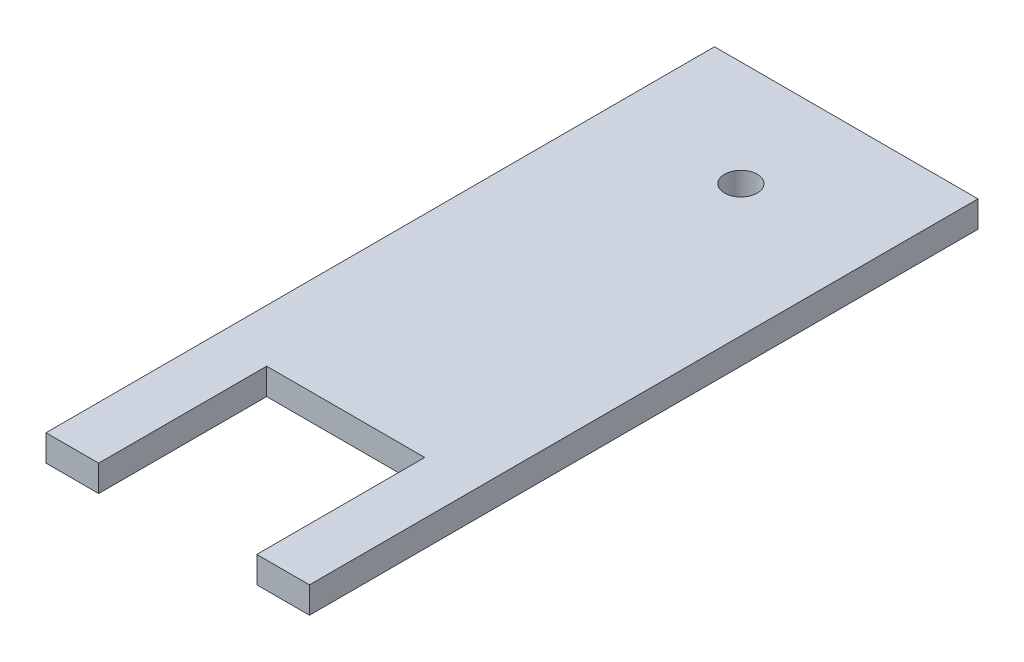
ISO-10303-21;
HEADER;
FILE_DESCRIPTION(('STEP AP214'),'2;1');
FILE_NAME('part.step','',(''),(''),'','','');
FILE_SCHEMA(('AUTOMOTIVE_DESIGN { 1 0 10303 214 1 1 1 1 }'));
ENDSEC;
DATA;
#1=APPLICATION_CONTEXT('core data for automotive mechanical design processes');
#2=APPLICATION_PROTOCOL_DEFINITION('international standard','automotive_design',2000,#1);
#3=PRODUCT_CONTEXT('',#1,'mechanical');
#4=PRODUCT('Part','Part','',(#3));
#5=PRODUCT_RELATED_PRODUCT_CATEGORY('part','',(#4));
#6=PRODUCT_DEFINITION_FORMATION('','',#4);
#7=PRODUCT_DEFINITION_CONTEXT('part definition',#1,'design');
#8=PRODUCT_DEFINITION('design','',#6,#7);
#9=PRODUCT_DEFINITION_SHAPE('','',#8);
#10=(LENGTH_UNIT() NAMED_UNIT(*) SI_UNIT(.MILLI.,.METRE.));
#11=(NAMED_UNIT(*) PLANE_ANGLE_UNIT() SI_UNIT($,.RADIAN.));
#12=(NAMED_UNIT(*) SI_UNIT($,.STERADIAN.) SOLID_ANGLE_UNIT());
#13=UNCERTAINTY_MEASURE_WITH_UNIT(LENGTH_MEASURE(1.E-05),#10,'distance_accuracy_value','');
#14=(GEOMETRIC_REPRESENTATION_CONTEXT(3) GLOBAL_UNCERTAINTY_ASSIGNED_CONTEXT((#13)) GLOBAL_UNIT_ASSIGNED_CONTEXT((#10,
#11,#12)) REPRESENTATION_CONTEXT('',''));
#15=CARTESIAN_POINT('',(0.,0.,0.));
#16=DIRECTION('',(0.,0.,1.));
#17=DIRECTION('',(1.,0.,0.));
#18=AXIS2_PLACEMENT_3D('',#15,#16,#17);
#19=CARTESIAN_POINT('',(0.,12.7,-241.3));
#20=DIRECTION('',(0.,0.,-1.));
#21=DIRECTION('',(-1.,0.,0.));
#22=AXIS2_PLACEMENT_3D('',#19,#20,#21);
#23=PLANE('',#22);
#24=DIRECTION('',(1.,0.,0.));
#25=VECTOR('',#24,1.);
#26=CARTESIAN_POINT('',(0.,0.,-241.3));
#27=LINE('',#26,#25);
#28=CARTESIAN_POINT('',(0.,0.,-241.3));
#29=VERTEX_POINT('',#28);
#30=CARTESIAN_POINT('',(127.,0.,-241.3));
#31=VERTEX_POINT('',#30);
#32=EDGE_CURVE('E132',#29,#31,#27,.T.);
#33=ORIENTED_EDGE('',*,*,#32,.F.);
#34=DIRECTION('',(0.,-1.,0.));
#35=VECTOR('',#34,1.);
#36=CARTESIAN_POINT('',(0.,12.7,-241.3));
#37=LINE('',#36,#35);
#38=CARTESIAN_POINT('',(0.,12.7,-241.3));
#39=VERTEX_POINT('',#38);
#40=EDGE_CURVE('E11',#39,#29,#37,.T.);
#41=ORIENTED_EDGE('',*,*,#40,.F.);
#42=DIRECTION('',(1.,0.,0.));
#43=VECTOR('',#42,1.);
#44=CARTESIAN_POINT('',(0.,12.7,-241.3));
#45=LINE('',#44,#43);
#46=CARTESIAN_POINT('',(127.,12.7,-241.3));
#47=VERTEX_POINT('',#46);
#48=EDGE_CURVE('E181',#39,#47,#45,.T.);
#49=ORIENTED_EDGE('',*,*,#48,.T.);
#50=DIRECTION('',(0.,-1.,0.));
#51=VECTOR('',#50,1.);
#52=CARTESIAN_POINT('',(127.,12.7,-241.3));
#53=LINE('',#52,#51);
#54=EDGE_CURVE('E86',#47,#31,#53,.T.);
#55=ORIENTED_EDGE('',*,*,#54,.T.);
#56=EDGE_LOOP('',(#33,#41,#49,#55));
#57=FACE_BOUND('',#56,.T.);
#58=ADVANCED_FACE('F35',(#57),#23,.T.);
#59=CARTESIAN_POINT('',(0.,12.7,0.));
#60=DIRECTION('',(-1.,0.,0.));
#61=DIRECTION('',(0.,0.,1.));
#62=AXIS2_PLACEMENT_3D('',#59,#60,#61);
#63=PLANE('',#62);
#64=DIRECTION('',(0.,0.,-1.));
#65=VECTOR('',#64,1.);
#66=CARTESIAN_POINT('',(0.,0.,0.));
#67=LINE('',#66,#65);
#68=CARTESIAN_POINT('',(0.,0.,80.9625));
#69=VERTEX_POINT('',#68);
#70=EDGE_CURVE('E135',#69,#29,#67,.T.);
#71=ORIENTED_EDGE('',*,*,#70,.F.);
#72=DIRECTION('',(0.,-1.,0.));
#73=VECTOR('',#72,1.);
#74=CARTESIAN_POINT('',(0.,12.7,80.9625));
#75=LINE('',#74,#73);
#76=CARTESIAN_POINT('',(0.,12.7,80.9625));
#77=VERTEX_POINT('',#76);
#78=EDGE_CURVE('E44',#77,#69,#75,.T.);
#79=ORIENTED_EDGE('',*,*,#78,.F.);
#80=DIRECTION('',(0.,0.,-1.));
#81=VECTOR('',#80,1.);
#82=CARTESIAN_POINT('',(0.,12.7,0.));
#83=LINE('',#82,#81);
#84=EDGE_CURVE('E178',#77,#39,#83,.T.);
#85=ORIENTED_EDGE('',*,*,#84,.T.);
#86=ORIENTED_EDGE('',*,*,#40,.T.);
#87=EDGE_LOOP('',(#71,#79,#85,#86));
#88=FACE_BOUND('',#87,.T.);
#89=ADVANCED_FACE('F169',(#88),#63,.T.);
#90=CARTESIAN_POINT('',(0.,12.7,80.9625));
#91=DIRECTION('',(0.,0.,1.));
#92=DIRECTION('',(1.,0.,0.));
#93=AXIS2_PLACEMENT_3D('',#90,#91,#92);
#94=PLANE('',#93);
#95=DIRECTION('',(-1.,0.,0.));
#96=VECTOR('',#95,1.);
#97=CARTESIAN_POINT('',(0.,0.,80.9625));
#98=LINE('',#97,#96);
#99=CARTESIAN_POINT('',(25.4,0.,80.9625));
#100=VERTEX_POINT('',#99);
#101=EDGE_CURVE('E138',#100,#69,#98,.T.);
#102=ORIENTED_EDGE('',*,*,#101,.F.);
#103=DIRECTION('',(0.,-1.,0.));
#104=VECTOR('',#103,1.);
#105=CARTESIAN_POINT('',(25.4,12.7,80.9625));
#106=LINE('',#105,#104);
#107=CARTESIAN_POINT('',(25.4,12.7,80.9625));
#108=VERTEX_POINT('',#107);
#109=EDGE_CURVE('E158',#108,#100,#106,.T.);
#110=ORIENTED_EDGE('',*,*,#109,.F.);
#111=DIRECTION('',(-1.,0.,0.));
#112=VECTOR('',#111,1.);
#113=CARTESIAN_POINT('',(0.,12.7,80.9625));
#114=LINE('',#113,#112);
#115=EDGE_CURVE('E165',#108,#77,#114,.T.);
#116=ORIENTED_EDGE('',*,*,#115,.T.);
#117=ORIENTED_EDGE('',*,*,#78,.T.);
#118=EDGE_LOOP('',(#102,#110,#116,#117));
#119=FACE_BOUND('',#118,.T.);
#120=ADVANCED_FACE('F163',(#119),#94,.T.);
#121=CARTESIAN_POINT('',(25.4,12.7,0.));
#122=DIRECTION('',(1.,0.,0.));
#123=DIRECTION('',(0.,0.,-1.));
#124=AXIS2_PLACEMENT_3D('',#121,#122,#123);
#125=PLANE('',#124);
#126=DIRECTION('',(0.,0.,1.));
#127=VECTOR('',#126,1.);
#128=CARTESIAN_POINT('',(25.4,0.,0.));
#129=LINE('',#128,#127);
#130=CARTESIAN_POINT('',(25.4,0.,0.));
#131=VERTEX_POINT('',#130);
#132=EDGE_CURVE('E141',#131,#100,#129,.T.);
#133=ORIENTED_EDGE('',*,*,#132,.F.);
#134=DIRECTION('',(0.,-1.,0.));
#135=VECTOR('',#134,1.);
#136=CARTESIAN_POINT('',(25.4,12.7,0.));
#137=LINE('',#136,#135);
#138=CARTESIAN_POINT('',(25.4,12.7,0.));
#139=VERTEX_POINT('',#138);
#140=EDGE_CURVE('E156',#139,#131,#137,.T.);
#141=ORIENTED_EDGE('',*,*,#140,.F.);
#142=DIRECTION('',(0.,0.,1.));
#143=VECTOR('',#142,1.);
#144=CARTESIAN_POINT('',(25.4,12.7,0.));
#145=LINE('',#144,#143);
#146=EDGE_CURVE('E177',#139,#108,#145,.T.);
#147=ORIENTED_EDGE('',*,*,#146,.T.);
#148=ORIENTED_EDGE('',*,*,#109,.T.);
#149=EDGE_LOOP('',(#133,#141,#147,#148));
#150=FACE_BOUND('',#149,.T.);
#151=ADVANCED_FACE('F175',(#150),#125,.T.);
#152=CARTESIAN_POINT('',(0.,12.7,0.));
#153=DIRECTION('',(0.,0.,-1.));
#154=DIRECTION('',(-1.,0.,0.));
#155=AXIS2_PLACEMENT_3D('',#152,#153,#154);
#156=PLANE('',#155);
#157=DIRECTION('',(1.,0.,0.));
#158=VECTOR('',#157,1.);
#159=CARTESIAN_POINT('',(0.,0.,0.));
#160=LINE('',#159,#158);
#161=CARTESIAN_POINT('',(101.6,0.,0.));
#162=VERTEX_POINT('',#161);
#163=EDGE_CURVE('E144',#131,#162,#160,.T.);
#164=ORIENTED_EDGE('',*,*,#163,.T.);
#165=DIRECTION('',(0.,-1.,0.));
#166=VECTOR('',#165,1.);
#167=CARTESIAN_POINT('',(101.6,12.7,0.));
#168=LINE('',#167,#166);
#169=CARTESIAN_POINT('',(101.6,12.7,0.));
#170=VERTEX_POINT('',#169);
#171=EDGE_CURVE('E122',#170,#162,#168,.T.);
#172=ORIENTED_EDGE('',*,*,#171,.F.);
#173=DIRECTION('',(1.,0.,0.));
#174=VECTOR('',#173,1.);
#175=CARTESIAN_POINT('',(0.,12.7,0.));
#176=LINE('',#175,#174);
#177=EDGE_CURVE('E110',#139,#170,#176,.T.);
#178=ORIENTED_EDGE('',*,*,#177,.F.);
#179=ORIENTED_EDGE('',*,*,#140,.T.);
#180=EDGE_LOOP('',(#164,#172,#178,#179));
#181=FACE_BOUND('',#180,.T.);
#182=ADVANCED_FACE('F210',(#181),#156,.F.);
#183=CARTESIAN_POINT('',(101.6,12.7,0.));
#184=DIRECTION('',(1.,0.,0.));
#185=DIRECTION('',(0.,0.,-1.));
#186=AXIS2_PLACEMENT_3D('',#183,#184,#185);
#187=PLANE('',#186);
#188=DIRECTION('',(0.,0.,1.));
#189=VECTOR('',#188,1.);
#190=CARTESIAN_POINT('',(101.6,0.,0.));
#191=LINE('',#190,#189);
#192=CARTESIAN_POINT('',(101.6,0.,80.9625));
#193=VERTEX_POINT('',#192);
#194=EDGE_CURVE('E118',#162,#193,#191,.T.);
#195=ORIENTED_EDGE('',*,*,#194,.T.);
#196=DIRECTION('',(0.,-1.,0.));
#197=VECTOR('',#196,1.);
#198=CARTESIAN_POINT('',(101.6,12.7,80.9625));
#199=LINE('',#198,#197);
#200=CARTESIAN_POINT('',(101.6,12.7,80.9625));
#201=VERTEX_POINT('',#200);
#202=EDGE_CURVE('E116',#201,#193,#199,.T.);
#203=ORIENTED_EDGE('',*,*,#202,.F.);
#204=DIRECTION('',(0.,0.,1.));
#205=VECTOR('',#204,1.);
#206=CARTESIAN_POINT('',(101.6,12.7,0.));
#207=LINE('',#206,#205);
#208=EDGE_CURVE('E103',#170,#201,#207,.T.);
#209=ORIENTED_EDGE('',*,*,#208,.F.);
#210=ORIENTED_EDGE('',*,*,#171,.T.);
#211=EDGE_LOOP('',(#195,#203,#209,#210));
#212=FACE_BOUND('',#211,.T.);
#213=ADVANCED_FACE('F117',(#212),#187,.F.);
#214=CARTESIAN_POINT('',(0.,12.7,80.9625));
#215=DIRECTION('',(0.,0.,1.));
#216=DIRECTION('',(1.,0.,0.));
#217=AXIS2_PLACEMENT_3D('',#214,#215,#216);
#218=PLANE('',#217);
#219=DIRECTION('',(-1.,0.,0.));
#220=VECTOR('',#219,1.);
#221=CARTESIAN_POINT('',(0.,0.,80.9625));
#222=LINE('',#221,#220);
#223=CARTESIAN_POINT('',(127.,0.,80.9625));
#224=VERTEX_POINT('',#223);
#225=EDGE_CURVE('E148',#224,#193,#222,.T.);
#226=ORIENTED_EDGE('',*,*,#225,.F.);
#227=DIRECTION('',(0.,-1.,0.));
#228=VECTOR('',#227,1.);
#229=CARTESIAN_POINT('',(127.,12.7,80.9625));
#230=LINE('',#229,#228);
#231=CARTESIAN_POINT('',(127.,12.7,80.9625));
#232=VERTEX_POINT('',#231);
#233=EDGE_CURVE('E79',#232,#224,#230,.T.);
#234=ORIENTED_EDGE('',*,*,#233,.F.);
#235=DIRECTION('',(-1.,0.,0.));
#236=VECTOR('',#235,1.);
#237=CARTESIAN_POINT('',(0.,12.7,80.9625));
#238=LINE('',#237,#236);
#239=EDGE_CURVE('E107',#232,#201,#238,.T.);
#240=ORIENTED_EDGE('',*,*,#239,.T.);
#241=ORIENTED_EDGE('',*,*,#202,.T.);
#242=EDGE_LOOP('',(#226,#234,#240,#241));
#243=FACE_BOUND('',#242,.T.);
#244=ADVANCED_FACE('F124',(#243),#218,.T.);
#245=CARTESIAN_POINT('',(63.5,12.7,-190.5));
#246=DIRECTION('',(0.,-1.,0.));
#247=DIRECTION('',(0.,0.,-1.));
#248=AXIS2_PLACEMENT_3D('',#245,#246,#247);
#249=CYLINDRICAL_SURFACE('',#248,7.874);
#250=CARTESIAN_POINT('',(63.5,12.7,-190.5));
#251=DIRECTION('',(0.,1.,0.));
#252=DIRECTION('',(0.,0.,1.));
#253=AXIS2_PLACEMENT_3D('',#250,#251,#252);
#254=CIRCLE('',#253,7.874);
#255=CARTESIAN_POINT('',(63.5,12.7,-182.626));
#256=VERTEX_POINT('',#255);
#257=EDGE_CURVE('E152',#256,#256,#254,.T.);
#258=ORIENTED_EDGE('',*,*,#257,.T.);
#259=EDGE_LOOP('',(#258));
#260=FACE_BOUND('',#259,.T.);
#261=CARTESIAN_POINT('',(63.5,0.,-190.5));
#262=DIRECTION('',(0.,1.,0.));
#263=DIRECTION('',(0.,0.,1.));
#264=AXIS2_PLACEMENT_3D('',#261,#262,#263);
#265=CIRCLE('',#264,7.874);
#266=CARTESIAN_POINT('',(63.5,0.,-182.626));
#267=VERTEX_POINT('',#266);
#268=EDGE_CURVE('E129',#267,#267,#265,.T.);
#269=ORIENTED_EDGE('',*,*,#268,.F.);
#270=EDGE_LOOP('',(#269));
#271=FACE_BOUND('',#270,.T.);
#272=ADVANCED_FACE('F37',(#260,#271),#249,.F.);
#273=CARTESIAN_POINT('',(127.,12.7,0.));
#274=DIRECTION('',(-1.,0.,0.));
#275=DIRECTION('',(0.,0.,1.));
#276=AXIS2_PLACEMENT_3D('',#273,#274,#275);
#277=PLANE('',#276);
#278=DIRECTION('',(0.,0.,-1.));
#279=VECTOR('',#278,1.);
#280=CARTESIAN_POINT('',(127.,0.,0.));
#281=LINE('',#280,#279);
#282=EDGE_CURVE('E150',#224,#31,#281,.T.);
#283=ORIENTED_EDGE('',*,*,#282,.T.);
#284=ORIENTED_EDGE('',*,*,#54,.F.);
#285=DIRECTION('',(0.,0.,-1.));
#286=VECTOR('',#285,1.);
#287=CARTESIAN_POINT('',(127.,12.7,0.));
#288=LINE('',#287,#286);
#289=EDGE_CURVE('E52',#232,#47,#288,.T.);
#290=ORIENTED_EDGE('',*,*,#289,.F.);
#291=ORIENTED_EDGE('',*,*,#233,.T.);
#292=EDGE_LOOP('',(#283,#284,#290,#291));
#293=FACE_BOUND('',#292,.T.);
#294=ADVANCED_FACE('F191',(#293),#277,.F.);
#295=CARTESIAN_POINT('',(0.,12.7,0.));
#296=DIRECTION('',(0.,1.,0.));
#297=DIRECTION('',(0.,0.,1.));
#298=AXIS2_PLACEMENT_3D('',#295,#296,#297);
#299=PLANE('',#298);
#300=ORIENTED_EDGE('',*,*,#257,.F.);
#301=EDGE_LOOP('',(#300));
#302=FACE_BOUND('',#301,.T.);
#303=ORIENTED_EDGE('',*,*,#48,.F.);
#304=ORIENTED_EDGE('',*,*,#84,.F.);
#305=ORIENTED_EDGE('',*,*,#115,.F.);
#306=ORIENTED_EDGE('',*,*,#146,.F.);
#307=ORIENTED_EDGE('',*,*,#177,.T.);
#308=ORIENTED_EDGE('',*,*,#208,.T.);
#309=ORIENTED_EDGE('',*,*,#239,.F.);
#310=ORIENTED_EDGE('',*,*,#289,.T.);
#311=EDGE_LOOP('',(#303,#304,#305,#306,#307,#308,#309,#310));
#312=FACE_BOUND('',#311,.T.);
#313=ADVANCED_FACE('F105',(#302,#312),#299,.T.);
#314=CARTESIAN_POINT('',(0.,0.,0.));
#315=DIRECTION('',(0.,1.,0.));
#316=DIRECTION('',(0.,0.,1.));
#317=AXIS2_PLACEMENT_3D('',#314,#315,#316);
#318=PLANE('',#317);
#319=ORIENTED_EDGE('',*,*,#268,.T.);
#320=EDGE_LOOP('',(#319));
#321=FACE_BOUND('',#320,.T.);
#322=ORIENTED_EDGE('',*,*,#32,.T.);
#323=ORIENTED_EDGE('',*,*,#282,.F.);
#324=ORIENTED_EDGE('',*,*,#225,.T.);
#325=ORIENTED_EDGE('',*,*,#194,.F.);
#326=ORIENTED_EDGE('',*,*,#163,.F.);
#327=ORIENTED_EDGE('',*,*,#132,.T.);
#328=ORIENTED_EDGE('',*,*,#101,.T.);
#329=ORIENTED_EDGE('',*,*,#70,.T.);
#330=EDGE_LOOP('',(#322,#323,#324,#325,#326,#327,#328,#329));
#331=FACE_BOUND('',#330,.T.);
#332=ADVANCED_FACE('F171',(#321,#331),#318,.F.);
#333=CLOSED_SHELL('',(#58,#89,#120,#151,#182,#213,#244,#272,#294,#313,#332));
#334=MANIFOLD_SOLID_BREP('B2',#333);
#335=ADVANCED_BREP_SHAPE_REPRESENTATION('',(#18,#334),#14);
#336=SHAPE_DEFINITION_REPRESENTATION(#9,#335);
ENDSEC;
END-ISO-10303-21;
